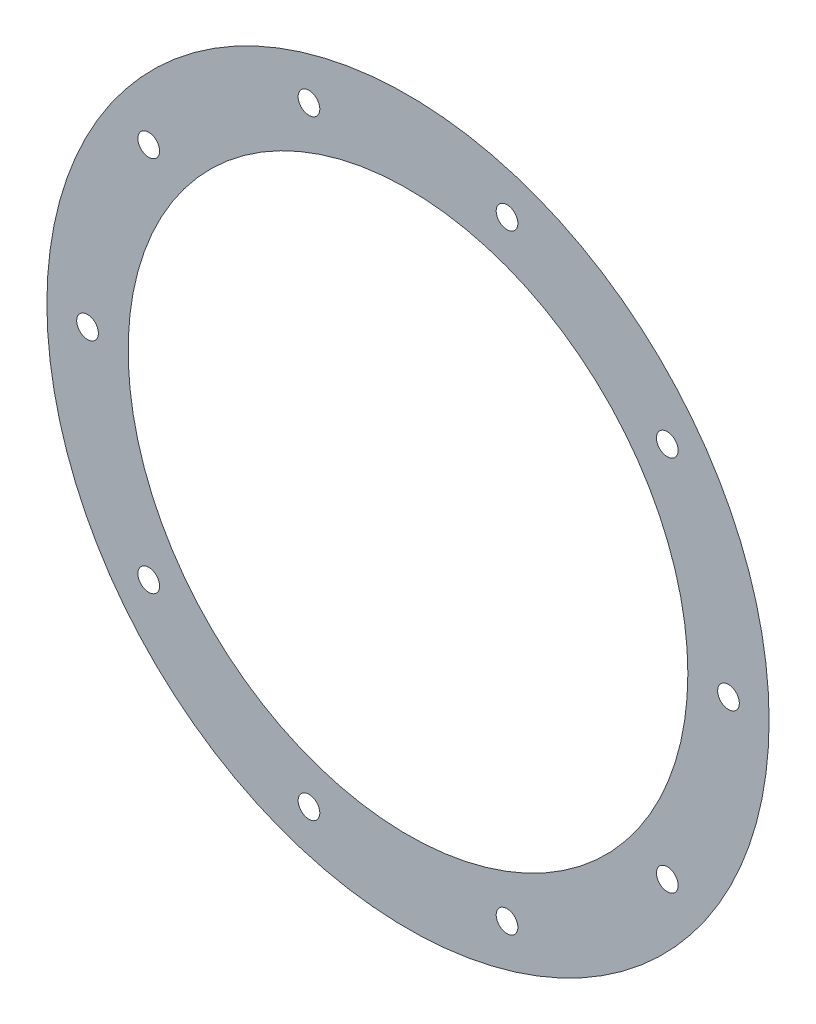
ISO-10303-21;
HEADER;
FILE_DESCRIPTION(('STEP AP214'),'2;1');
FILE_NAME('part.step','',(''),(''),'','','');
FILE_SCHEMA(('AUTOMOTIVE_DESIGN { 1 0 10303 214 1 1 1 1 }'));
ENDSEC;
DATA;
#1=APPLICATION_CONTEXT('core data for automotive mechanical design processes');
#2=APPLICATION_PROTOCOL_DEFINITION('international standard','automotive_design',2000,#1);
#3=PRODUCT_CONTEXT('',#1,'mechanical');
#4=PRODUCT('Part','Part','',(#3));
#5=PRODUCT_RELATED_PRODUCT_CATEGORY('part','',(#4));
#6=PRODUCT_DEFINITION_FORMATION('','',#4);
#7=PRODUCT_DEFINITION_CONTEXT('part definition',#1,'design');
#8=PRODUCT_DEFINITION('design','',#6,#7);
#9=PRODUCT_DEFINITION_SHAPE('','',#8);
#10=(LENGTH_UNIT() NAMED_UNIT(*) SI_UNIT(.MILLI.,.METRE.));
#11=(NAMED_UNIT(*) PLANE_ANGLE_UNIT() SI_UNIT($,.RADIAN.));
#12=(NAMED_UNIT(*) SI_UNIT($,.STERADIAN.) SOLID_ANGLE_UNIT());
#13=UNCERTAINTY_MEASURE_WITH_UNIT(LENGTH_MEASURE(1.E-05),#10,'distance_accuracy_value','');
#14=(GEOMETRIC_REPRESENTATION_CONTEXT(3) GLOBAL_UNCERTAINTY_ASSIGNED_CONTEXT((#13)) GLOBAL_UNIT_ASSIGNED_CONTEXT((#10,
#11,#12)) REPRESENTATION_CONTEXT('',''));
#15=CARTESIAN_POINT('',(0.,0.,0.));
#16=DIRECTION('',(0.,0.,1.));
#17=DIRECTION('',(1.,0.,0.));
#18=AXIS2_PLACEMENT_3D('',#15,#16,#17);
#19=CARTESIAN_POINT('',(0.,0.,0.0001));
#20=DIRECTION('',(0.,0.,1.));
#21=DIRECTION('',(1.,0.,0.));
#22=AXIS2_PLACEMENT_3D('',#19,#20,#21);
#23=PLANE('',#22);
#24=CARTESIAN_POINT('',(-143.600516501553,-104.331882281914,9.99999999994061E-05));
#25=DIRECTION('',(0.,0.,1.));
#26=DIRECTION('',(1.,0.,0.));
#27=AXIS2_PLACEMENT_3D('',#24,#25,#26);
#28=CIRCLE('',#27,6.00000000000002);
#29=CARTESIAN_POINT('',(-137.600516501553,-104.331882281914,9.99999999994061E-05));
#30=VERTEX_POINT('',#29);
#31=EDGE_CURVE('E84',#30,#30,#28,.T.);
#32=ORIENTED_EDGE('',*,*,#31,.F.);
#33=EDGE_LOOP('',(#32));
#34=FACE_BOUND('',#33,.T.);
#35=CARTESIAN_POINT('',(-54.8505165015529,-168.81253164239,9.99999999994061E-05));
#36=DIRECTION('',(0.,0.,1.));
#37=DIRECTION('',(1.,0.,0.));
#38=AXIS2_PLACEMENT_3D('',#35,#36,#37);
#39=CIRCLE('',#38,6.);
#40=CARTESIAN_POINT('',(-48.8505165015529,-168.81253164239,9.99999999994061E-05));
#41=VERTEX_POINT('',#40);
#42=EDGE_CURVE('E81',#41,#41,#39,.T.);
#43=ORIENTED_EDGE('',*,*,#42,.F.);
#44=EDGE_LOOP('',(#43));
#45=FACE_BOUND('',#44,.T.);
#46=CARTESIAN_POINT('',(54.8505165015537,-168.81253164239,9.99999999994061E-05));
#47=DIRECTION('',(0.,0.,1.));
#48=DIRECTION('',(1.,0.,0.));
#49=AXIS2_PLACEMENT_3D('',#46,#47,#48);
#50=CIRCLE('',#49,6.);
#51=CARTESIAN_POINT('',(60.8505165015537,-168.81253164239,9.99999999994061E-05));
#52=VERTEX_POINT('',#51);
#53=EDGE_CURVE('E78',#52,#52,#50,.T.);
#54=ORIENTED_EDGE('',*,*,#53,.F.);
#55=EDGE_LOOP('',(#54));
#56=FACE_BOUND('',#55,.T.);
#57=CARTESIAN_POINT('',(143.600516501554,-104.331882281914,9.99999999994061E-05));
#58=DIRECTION('',(0.,0.,1.));
#59=DIRECTION('',(1.,0.,0.));
#60=AXIS2_PLACEMENT_3D('',#57,#58,#59);
#61=CIRCLE('',#60,6.00000000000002);
#62=CARTESIAN_POINT('',(149.600516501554,-104.331882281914,9.99999999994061E-05));
#63=VERTEX_POINT('',#62);
#64=EDGE_CURVE('E74',#63,#63,#61,.T.);
#65=ORIENTED_EDGE('',*,*,#64,.F.);
#66=EDGE_LOOP('',(#65));
#67=FACE_BOUND('',#66,.T.);
#68=CARTESIAN_POINT('',(177.500000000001,0.,9.99999999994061E-05));
#69=DIRECTION('',(0.,0.,1.));
#70=DIRECTION('',(1.,0.,0.));
#71=AXIS2_PLACEMENT_3D('',#68,#69,#70);
#72=CIRCLE('',#71,6.00000000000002);
#73=CARTESIAN_POINT('',(183.500000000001,0.,9.99999999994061E-05));
#74=VERTEX_POINT('',#73);
#75=EDGE_CURVE('E70',#74,#74,#72,.T.);
#76=ORIENTED_EDGE('',*,*,#75,.F.);
#77=EDGE_LOOP('',(#76));
#78=FACE_BOUND('',#77,.T.);
#79=CARTESIAN_POINT('',(143.600516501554,104.331882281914,9.99999999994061E-05));
#80=DIRECTION('',(0.,0.,1.));
#81=DIRECTION('',(1.,0.,0.));
#82=AXIS2_PLACEMENT_3D('',#79,#80,#81);
#83=CIRCLE('',#82,6.00000000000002);
#84=CARTESIAN_POINT('',(149.600516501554,104.331882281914,9.99999999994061E-05));
#85=VERTEX_POINT('',#84);
#86=EDGE_CURVE('E66',#85,#85,#83,.T.);
#87=ORIENTED_EDGE('',*,*,#86,.F.);
#88=EDGE_LOOP('',(#87));
#89=FACE_BOUND('',#88,.T.);
#90=CARTESIAN_POINT('',(54.8505165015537,168.81253164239,9.99999999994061E-05));
#91=DIRECTION('',(0.,0.,1.));
#92=DIRECTION('',(1.,0.,0.));
#93=AXIS2_PLACEMENT_3D('',#90,#91,#92);
#94=CIRCLE('',#93,6.);
#95=CARTESIAN_POINT('',(60.8505165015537,168.81253164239,9.99999999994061E-05));
#96=VERTEX_POINT('',#95);
#97=EDGE_CURVE('E62',#96,#96,#94,.T.);
#98=ORIENTED_EDGE('',*,*,#97,.F.);
#99=EDGE_LOOP('',(#98));
#100=FACE_BOUND('',#99,.T.);
#101=CARTESIAN_POINT('',(-54.8505165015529,168.81253164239,9.99999999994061E-05));
#102=DIRECTION('',(0.,0.,1.));
#103=DIRECTION('',(1.,0.,0.));
#104=AXIS2_PLACEMENT_3D('',#101,#102,#103);
#105=CIRCLE('',#104,6.);
#106=CARTESIAN_POINT('',(-48.8505165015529,168.81253164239,9.99999999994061E-05));
#107=VERTEX_POINT('',#106);
#108=EDGE_CURVE('E58',#107,#107,#105,.T.);
#109=ORIENTED_EDGE('',*,*,#108,.F.);
#110=EDGE_LOOP('',(#109));
#111=FACE_BOUND('',#110,.T.);
#112=CARTESIAN_POINT('',(-143.600516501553,104.331882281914,9.99999999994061E-05));
#113=DIRECTION('',(0.,0.,1.));
#114=DIRECTION('',(1.,0.,0.));
#115=AXIS2_PLACEMENT_3D('',#112,#113,#114);
#116=CIRCLE('',#115,6.00000000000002);
#117=CARTESIAN_POINT('',(-137.600516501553,104.331882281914,9.99999999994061E-05));
#118=VERTEX_POINT('',#117);
#119=EDGE_CURVE('E54',#118,#118,#116,.T.);
#120=ORIENTED_EDGE('',*,*,#119,.F.);
#121=EDGE_LOOP('',(#120));
#122=FACE_BOUND('',#121,.T.);
#123=CARTESIAN_POINT('',(-177.5,0.,9.99999999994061E-05));
#124=DIRECTION('',(0.,0.,1.));
#125=DIRECTION('',(1.,0.,0.));
#126=AXIS2_PLACEMENT_3D('',#123,#124,#125);
#127=CIRCLE('',#126,6.00000000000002);
#128=CARTESIAN_POINT('',(-171.5,0.,9.99999999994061E-05));
#129=VERTEX_POINT('',#128);
#130=EDGE_CURVE('E53',#129,#129,#127,.T.);
#131=ORIENTED_EDGE('',*,*,#130,.F.);
#132=EDGE_LOOP('',(#131));
#133=FACE_BOUND('',#132,.T.);
#134=CARTESIAN_POINT('',(0.,0.,0.0001));
#135=DIRECTION('',(0.,0.,1.));
#136=DIRECTION('',(1.,0.,0.));
#137=AXIS2_PLACEMENT_3D('',#134,#135,#136);
#138=CIRCLE('',#137,200.);
#139=CARTESIAN_POINT('',(200.,0.,0.0001));
#140=VERTEX_POINT('',#139);
#141=EDGE_CURVE('E10',#140,#140,#138,.T.);
#142=ORIENTED_EDGE('',*,*,#141,.T.);
#143=EDGE_LOOP('',(#142));
#144=FACE_BOUND('',#143,.T.);
#145=CARTESIAN_POINT('',(0.,0.,0.0001));
#146=DIRECTION('',(0.,0.,1.));
#147=DIRECTION('',(1.,0.,0.));
#148=AXIS2_PLACEMENT_3D('',#145,#146,#147);
#149=CIRCLE('',#148,155.);
#150=CARTESIAN_POINT('',(155.,0.,0.0001));
#151=VERTEX_POINT('',#150);
#152=EDGE_CURVE('E44',#151,#151,#149,.T.);
#153=ORIENTED_EDGE('',*,*,#152,.F.);
#154=EDGE_LOOP('',(#153));
#155=FACE_BOUND('',#154,.T.);
#156=ADVANCED_FACE('F31',(#34,#45,#56,#67,#78,#89,#100,#111,#122,#133,#144,#155),#23,.T.);
#157=CARTESIAN_POINT('',(0.,0.,0.));
#158=DIRECTION('',(0.,0.,1.));
#159=DIRECTION('',(1.,0.,0.));
#160=AXIS2_PLACEMENT_3D('',#157,#158,#159);
#161=PLANE('',#160);
#162=CARTESIAN_POINT('',(-143.600516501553,-104.331882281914,0.));
#163=DIRECTION('',(0.,0.,1.));
#164=DIRECTION('',(1.,0.,0.));
#165=AXIS2_PLACEMENT_3D('',#162,#163,#164);
#166=CIRCLE('',#165,6.00000000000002);
#167=CARTESIAN_POINT('',(-137.600516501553,-104.331882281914,0.));
#168=VERTEX_POINT('',#167);
#169=EDGE_CURVE('E35',#168,#168,#166,.T.);
#170=ORIENTED_EDGE('',*,*,#169,.T.);
#171=EDGE_LOOP('',(#170));
#172=FACE_BOUND('',#171,.T.);
#173=CARTESIAN_POINT('',(-54.8505165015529,-168.81253164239,0.));
#174=DIRECTION('',(0.,0.,1.));
#175=DIRECTION('',(1.,0.,0.));
#176=AXIS2_PLACEMENT_3D('',#173,#174,#175);
#177=CIRCLE('',#176,6.);
#178=CARTESIAN_POINT('',(-48.8505165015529,-168.81253164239,0.));
#179=VERTEX_POINT('',#178);
#180=EDGE_CURVE('E82',#179,#179,#177,.T.);
#181=ORIENTED_EDGE('',*,*,#180,.T.);
#182=EDGE_LOOP('',(#181));
#183=FACE_BOUND('',#182,.T.);
#184=CARTESIAN_POINT('',(54.8505165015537,-168.81253164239,0.));
#185=DIRECTION('',(0.,0.,1.));
#186=DIRECTION('',(1.,0.,0.));
#187=AXIS2_PLACEMENT_3D('',#184,#185,#186);
#188=CIRCLE('',#187,6.);
#189=CARTESIAN_POINT('',(60.8505165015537,-168.81253164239,0.));
#190=VERTEX_POINT('',#189);
#191=EDGE_CURVE('E79',#190,#190,#188,.T.);
#192=ORIENTED_EDGE('',*,*,#191,.T.);
#193=EDGE_LOOP('',(#192));
#194=FACE_BOUND('',#193,.T.);
#195=CARTESIAN_POINT('',(143.600516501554,-104.331882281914,0.));
#196=DIRECTION('',(0.,0.,1.));
#197=DIRECTION('',(1.,0.,0.));
#198=AXIS2_PLACEMENT_3D('',#195,#196,#197);
#199=CIRCLE('',#198,6.00000000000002);
#200=CARTESIAN_POINT('',(149.600516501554,-104.331882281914,0.));
#201=VERTEX_POINT('',#200);
#202=EDGE_CURVE('E75',#201,#201,#199,.T.);
#203=ORIENTED_EDGE('',*,*,#202,.T.);
#204=EDGE_LOOP('',(#203));
#205=FACE_BOUND('',#204,.T.);
#206=CARTESIAN_POINT('',(177.500000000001,0.,0.));
#207=DIRECTION('',(0.,0.,1.));
#208=DIRECTION('',(1.,0.,0.));
#209=AXIS2_PLACEMENT_3D('',#206,#207,#208);
#210=CIRCLE('',#209,6.00000000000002);
#211=CARTESIAN_POINT('',(183.500000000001,0.,0.));
#212=VERTEX_POINT('',#211);
#213=EDGE_CURVE('E71',#212,#212,#210,.T.);
#214=ORIENTED_EDGE('',*,*,#213,.T.);
#215=EDGE_LOOP('',(#214));
#216=FACE_BOUND('',#215,.T.);
#217=CARTESIAN_POINT('',(143.600516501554,104.331882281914,0.));
#218=DIRECTION('',(0.,0.,1.));
#219=DIRECTION('',(1.,0.,0.));
#220=AXIS2_PLACEMENT_3D('',#217,#218,#219);
#221=CIRCLE('',#220,6.00000000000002);
#222=CARTESIAN_POINT('',(149.600516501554,104.331882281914,0.));
#223=VERTEX_POINT('',#222);
#224=EDGE_CURVE('E67',#223,#223,#221,.T.);
#225=ORIENTED_EDGE('',*,*,#224,.T.);
#226=EDGE_LOOP('',(#225));
#227=FACE_BOUND('',#226,.T.);
#228=CARTESIAN_POINT('',(54.8505165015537,168.81253164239,0.));
#229=DIRECTION('',(0.,0.,1.));
#230=DIRECTION('',(1.,0.,0.));
#231=AXIS2_PLACEMENT_3D('',#228,#229,#230);
#232=CIRCLE('',#231,6.);
#233=CARTESIAN_POINT('',(60.8505165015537,168.81253164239,0.));
#234=VERTEX_POINT('',#233);
#235=EDGE_CURVE('E63',#234,#234,#232,.T.);
#236=ORIENTED_EDGE('',*,*,#235,.T.);
#237=EDGE_LOOP('',(#236));
#238=FACE_BOUND('',#237,.T.);
#239=CARTESIAN_POINT('',(-54.8505165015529,168.81253164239,0.));
#240=DIRECTION('',(0.,0.,1.));
#241=DIRECTION('',(1.,0.,0.));
#242=AXIS2_PLACEMENT_3D('',#239,#240,#241);
#243=CIRCLE('',#242,6.);
#244=CARTESIAN_POINT('',(-48.8505165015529,168.81253164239,0.));
#245=VERTEX_POINT('',#244);
#246=EDGE_CURVE('E59',#245,#245,#243,.T.);
#247=ORIENTED_EDGE('',*,*,#246,.T.);
#248=EDGE_LOOP('',(#247));
#249=FACE_BOUND('',#248,.T.);
#250=CARTESIAN_POINT('',(-143.600516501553,104.331882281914,0.));
#251=DIRECTION('',(0.,0.,1.));
#252=DIRECTION('',(1.,0.,0.));
#253=AXIS2_PLACEMENT_3D('',#250,#251,#252);
#254=CIRCLE('',#253,6.00000000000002);
#255=CARTESIAN_POINT('',(-137.600516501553,104.331882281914,0.));
#256=VERTEX_POINT('',#255);
#257=EDGE_CURVE('E55',#256,#256,#254,.T.);
#258=ORIENTED_EDGE('',*,*,#257,.T.);
#259=EDGE_LOOP('',(#258));
#260=FACE_BOUND('',#259,.T.);
#261=CARTESIAN_POINT('',(-177.5,0.,0.));
#262=DIRECTION('',(0.,0.,1.));
#263=DIRECTION('',(1.,0.,0.));
#264=AXIS2_PLACEMENT_3D('',#261,#262,#263);
#265=CIRCLE('',#264,6.00000000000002);
#266=CARTESIAN_POINT('',(-171.5,0.,0.));
#267=VERTEX_POINT('',#266);
#268=EDGE_CURVE('E50',#267,#267,#265,.T.);
#269=ORIENTED_EDGE('',*,*,#268,.T.);
#270=EDGE_LOOP('',(#269));
#271=FACE_BOUND('',#270,.T.);
#272=CARTESIAN_POINT('',(0.,0.,0.));
#273=DIRECTION('',(0.,0.,1.));
#274=DIRECTION('',(1.,0.,0.));
#275=AXIS2_PLACEMENT_3D('',#272,#273,#274);
#276=CIRCLE('',#275,200.);
#277=CARTESIAN_POINT('',(200.,0.,0.));
#278=VERTEX_POINT('',#277);
#279=EDGE_CURVE('E39',#278,#278,#276,.T.);
#280=ORIENTED_EDGE('',*,*,#279,.F.);
#281=EDGE_LOOP('',(#280));
#282=FACE_BOUND('',#281,.T.);
#283=CARTESIAN_POINT('',(0.,0.,0.));
#284=DIRECTION('',(0.,0.,1.));
#285=DIRECTION('',(1.,0.,0.));
#286=AXIS2_PLACEMENT_3D('',#283,#284,#285);
#287=CIRCLE('',#286,155.);
#288=CARTESIAN_POINT('',(155.,0.,0.));
#289=VERTEX_POINT('',#288);
#290=EDGE_CURVE('E47',#289,#289,#287,.T.);
#291=ORIENTED_EDGE('',*,*,#290,.T.);
#292=EDGE_LOOP('',(#291));
#293=FACE_BOUND('',#292,.T.);
#294=ADVANCED_FACE('F116',(#172,#183,#194,#205,#216,#227,#238,#249,#260,#271,#282,#293),#161,.F.);
#295=CARTESIAN_POINT('',(0.,0.,0.0001));
#296=DIRECTION('',(0.,0.,-1.));
#297=DIRECTION('',(-1.,0.,0.));
#298=AXIS2_PLACEMENT_3D('',#295,#296,#297);
#299=CYLINDRICAL_SURFACE('',#298,200.);
#300=ORIENTED_EDGE('',*,*,#141,.F.);
#301=EDGE_LOOP('',(#300));
#302=FACE_BOUND('',#301,.T.);
#303=ORIENTED_EDGE('',*,*,#279,.T.);
#304=EDGE_LOOP('',(#303));
#305=FACE_BOUND('',#304,.T.);
#306=ADVANCED_FACE('F33',(#302,#305),#299,.T.);
#307=CARTESIAN_POINT('',(0.,0.,0.0001));
#308=DIRECTION('',(0.,0.,-1.));
#309=DIRECTION('',(-1.,0.,0.));
#310=AXIS2_PLACEMENT_3D('',#307,#308,#309);
#311=CYLINDRICAL_SURFACE('',#310,155.);
#312=ORIENTED_EDGE('',*,*,#152,.T.);
#313=EDGE_LOOP('',(#312));
#314=FACE_BOUND('',#313,.T.);
#315=ORIENTED_EDGE('',*,*,#290,.F.);
#316=EDGE_LOOP('',(#315));
#317=FACE_BOUND('',#316,.T.);
#318=ADVANCED_FACE('F118',(#314,#317),#311,.F.);
#319=CARTESIAN_POINT('',(-177.5,0.,-30.));
#320=DIRECTION('',(0.,0.,1.));
#321=DIRECTION('',(1.,0.,0.));
#322=AXIS2_PLACEMENT_3D('',#319,#320,#321);
#323=CYLINDRICAL_SURFACE('',#322,6.00000000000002);
#324=ORIENTED_EDGE('',*,*,#130,.T.);
#325=EDGE_LOOP('',(#324));
#326=FACE_BOUND('',#325,.T.);
#327=ORIENTED_EDGE('',*,*,#268,.F.);
#328=EDGE_LOOP('',(#327));
#329=FACE_BOUND('',#328,.T.);
#330=ADVANCED_FACE('F120',(#326,#329),#323,.F.);
#331=CARTESIAN_POINT('',(-143.600516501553,104.331882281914,-30.));
#332=DIRECTION('',(0.,0.,1.));
#333=DIRECTION('',(1.,0.,0.));
#334=AXIS2_PLACEMENT_3D('',#331,#332,#333);
#335=CYLINDRICAL_SURFACE('',#334,6.00000000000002);
#336=ORIENTED_EDGE('',*,*,#119,.T.);
#337=EDGE_LOOP('',(#336));
#338=FACE_BOUND('',#337,.T.);
#339=ORIENTED_EDGE('',*,*,#257,.F.);
#340=EDGE_LOOP('',(#339));
#341=FACE_BOUND('',#340,.T.);
#342=ADVANCED_FACE('F126',(#338,#341),#335,.F.);
#343=CARTESIAN_POINT('',(-54.8505165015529,168.81253164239,-30.));
#344=DIRECTION('',(0.,0.,1.));
#345=DIRECTION('',(1.,0.,0.));
#346=AXIS2_PLACEMENT_3D('',#343,#344,#345);
#347=CYLINDRICAL_SURFACE('',#346,6.);
#348=ORIENTED_EDGE('',*,*,#108,.T.);
#349=EDGE_LOOP('',(#348));
#350=FACE_BOUND('',#349,.T.);
#351=ORIENTED_EDGE('',*,*,#246,.F.);
#352=EDGE_LOOP('',(#351));
#353=FACE_BOUND('',#352,.T.);
#354=ADVANCED_FACE('F165',(#350,#353),#347,.F.);
#355=CARTESIAN_POINT('',(54.8505165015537,168.81253164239,-30.));
#356=DIRECTION('',(0.,0.,1.));
#357=DIRECTION('',(1.,0.,0.));
#358=AXIS2_PLACEMENT_3D('',#355,#356,#357);
#359=CYLINDRICAL_SURFACE('',#358,6.);
#360=ORIENTED_EDGE('',*,*,#97,.T.);
#361=EDGE_LOOP('',(#360));
#362=FACE_BOUND('',#361,.T.);
#363=ORIENTED_EDGE('',*,*,#235,.F.);
#364=EDGE_LOOP('',(#363));
#365=FACE_BOUND('',#364,.T.);
#366=ADVANCED_FACE('F172',(#362,#365),#359,.F.);
#367=CARTESIAN_POINT('',(143.600516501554,104.331882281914,-30.));
#368=DIRECTION('',(0.,0.,1.));
#369=DIRECTION('',(1.,0.,0.));
#370=AXIS2_PLACEMENT_3D('',#367,#368,#369);
#371=CYLINDRICAL_SURFACE('',#370,6.00000000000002);
#372=ORIENTED_EDGE('',*,*,#86,.T.);
#373=EDGE_LOOP('',(#372));
#374=FACE_BOUND('',#373,.T.);
#375=ORIENTED_EDGE('',*,*,#224,.F.);
#376=EDGE_LOOP('',(#375));
#377=FACE_BOUND('',#376,.T.);
#378=ADVANCED_FACE('F178',(#374,#377),#371,.F.);
#379=CARTESIAN_POINT('',(177.500000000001,0.,-30.));
#380=DIRECTION('',(0.,0.,1.));
#381=DIRECTION('',(1.,0.,0.));
#382=AXIS2_PLACEMENT_3D('',#379,#380,#381);
#383=CYLINDRICAL_SURFACE('',#382,6.00000000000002);
#384=ORIENTED_EDGE('',*,*,#75,.T.);
#385=EDGE_LOOP('',(#384));
#386=FACE_BOUND('',#385,.T.);
#387=ORIENTED_EDGE('',*,*,#213,.F.);
#388=EDGE_LOOP('',(#387));
#389=FACE_BOUND('',#388,.T.);
#390=ADVANCED_FACE('F182',(#386,#389),#383,.F.);
#391=CARTESIAN_POINT('',(143.600516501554,-104.331882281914,-30.));
#392=DIRECTION('',(0.,0.,1.));
#393=DIRECTION('',(1.,0.,0.));
#394=AXIS2_PLACEMENT_3D('',#391,#392,#393);
#395=CYLINDRICAL_SURFACE('',#394,6.00000000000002);
#396=ORIENTED_EDGE('',*,*,#64,.T.);
#397=EDGE_LOOP('',(#396));
#398=FACE_BOUND('',#397,.T.);
#399=ORIENTED_EDGE('',*,*,#202,.F.);
#400=EDGE_LOOP('',(#399));
#401=FACE_BOUND('',#400,.T.);
#402=ADVANCED_FACE('F186',(#398,#401),#395,.F.);
#403=CARTESIAN_POINT('',(54.8505165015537,-168.81253164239,-30.));
#404=DIRECTION('',(0.,0.,1.));
#405=DIRECTION('',(1.,0.,0.));
#406=AXIS2_PLACEMENT_3D('',#403,#404,#405);
#407=CYLINDRICAL_SURFACE('',#406,6.);
#408=ORIENTED_EDGE('',*,*,#53,.T.);
#409=EDGE_LOOP('',(#408));
#410=FACE_BOUND('',#409,.T.);
#411=ORIENTED_EDGE('',*,*,#191,.F.);
#412=EDGE_LOOP('',(#411));
#413=FACE_BOUND('',#412,.T.);
#414=ADVANCED_FACE('F190',(#410,#413),#407,.F.);
#415=CARTESIAN_POINT('',(-54.8505165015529,-168.81253164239,-30.));
#416=DIRECTION('',(0.,0.,1.));
#417=DIRECTION('',(1.,0.,0.));
#418=AXIS2_PLACEMENT_3D('',#415,#416,#417);
#419=CYLINDRICAL_SURFACE('',#418,6.);
#420=ORIENTED_EDGE('',*,*,#42,.T.);
#421=EDGE_LOOP('',(#420));
#422=FACE_BOUND('',#421,.T.);
#423=ORIENTED_EDGE('',*,*,#180,.F.);
#424=EDGE_LOOP('',(#423));
#425=FACE_BOUND('',#424,.T.);
#426=ADVANCED_FACE('F194',(#422,#425),#419,.F.);
#427=CARTESIAN_POINT('',(-143.600516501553,-104.331882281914,-30.));
#428=DIRECTION('',(0.,0.,1.));
#429=DIRECTION('',(1.,0.,0.));
#430=AXIS2_PLACEMENT_3D('',#427,#428,#429);
#431=CYLINDRICAL_SURFACE('',#430,6.00000000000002);
#432=ORIENTED_EDGE('',*,*,#31,.T.);
#433=EDGE_LOOP('',(#432));
#434=FACE_BOUND('',#433,.T.);
#435=ORIENTED_EDGE('',*,*,#169,.F.);
#436=EDGE_LOOP('',(#435));
#437=FACE_BOUND('',#436,.T.);
#438=ADVANCED_FACE('F198',(#434,#437),#431,.F.);
#439=CLOSED_SHELL('',(#156,#294,#306,#318,#330,#342,#354,#366,#378,#390,#402,#414,#426,#438));
#440=MANIFOLD_SOLID_BREP('B2',#439);
#441=ADVANCED_BREP_SHAPE_REPRESENTATION('',(#18,#440),#14);
#442=SHAPE_DEFINITION_REPRESENTATION(#9,#441);
ENDSEC;
END-ISO-10303-21;
